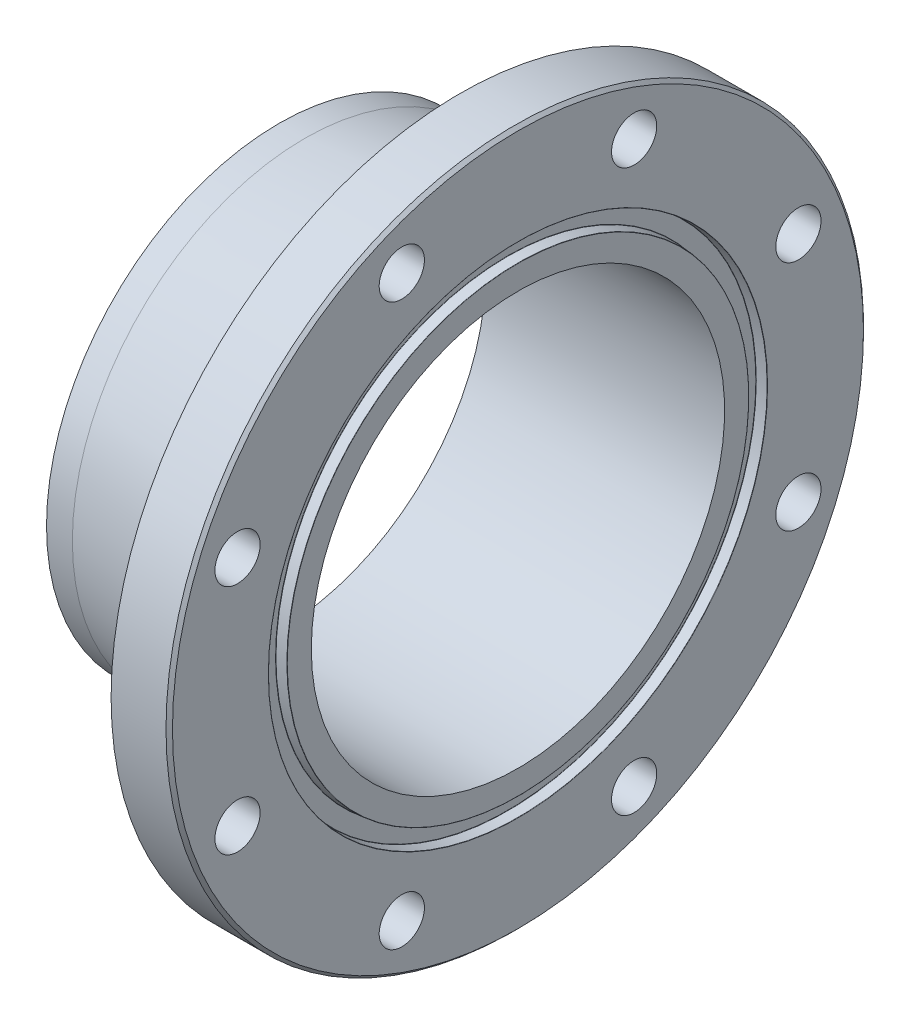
ISO-10303-21;
HEADER;
FILE_DESCRIPTION(('STEP AP214'),'2;1');
FILE_NAME('part.step','',(''),(''),'','','');
FILE_SCHEMA(('AUTOMOTIVE_DESIGN { 1 0 10303 214 1 1 1 1 }'));
ENDSEC;
DATA;
#1=APPLICATION_CONTEXT('core data for automotive mechanical design processes');
#2=APPLICATION_PROTOCOL_DEFINITION('international standard','automotive_design',2000,#1);
#3=PRODUCT_CONTEXT('',#1,'mechanical');
#4=PRODUCT('Part','Part','',(#3));
#5=PRODUCT_RELATED_PRODUCT_CATEGORY('part','',(#4));
#6=PRODUCT_DEFINITION_FORMATION('','',#4);
#7=PRODUCT_DEFINITION_CONTEXT('part definition',#1,'design');
#8=PRODUCT_DEFINITION('design','',#6,#7);
#9=PRODUCT_DEFINITION_SHAPE('','',#8);
#10=(LENGTH_UNIT() NAMED_UNIT(*) SI_UNIT(.MILLI.,.METRE.));
#11=(NAMED_UNIT(*) PLANE_ANGLE_UNIT() SI_UNIT($,.RADIAN.));
#12=(NAMED_UNIT(*) SI_UNIT($,.STERADIAN.) SOLID_ANGLE_UNIT());
#13=UNCERTAINTY_MEASURE_WITH_UNIT(LENGTH_MEASURE(1.E-05),#10,'distance_accuracy_value','');
#14=(GEOMETRIC_REPRESENTATION_CONTEXT(3) GLOBAL_UNCERTAINTY_ASSIGNED_CONTEXT((#13)) GLOBAL_UNIT_ASSIGNED_CONTEXT((#10,
#11,#12)) REPRESENTATION_CONTEXT('',''));
#15=CARTESIAN_POINT('',(0.,0.,0.));
#16=DIRECTION('',(0.,0.,1.));
#17=DIRECTION('',(1.,0.,0.));
#18=AXIS2_PLACEMENT_3D('',#15,#16,#17);
#19=CARTESIAN_POINT('',(0.,0.,-114.3));
#20=DIRECTION('',(1.,0.,0.));
#21=DIRECTION('',(0.,0.,-1.));
#22=AXIS2_PLACEMENT_3D('',#19,#20,#21);
#23=PLANE('',#22);
#24=CARTESIAN_POINT('',(0.,0.,0.));
#25=DIRECTION('',(-1.,0.,0.));
#26=DIRECTION('',(0.,0.,1.));
#27=AXIS2_PLACEMENT_3D('',#24,#25,#26);
#28=CIRCLE('',#27,101.6);
#29=CARTESIAN_POINT('',(0.,0.,101.6));
#30=VERTEX_POINT('',#29);
#31=EDGE_CURVE('E51',#30,#30,#28,.T.);
#32=ORIENTED_EDGE('',*,*,#31,.F.);
#33=EDGE_LOOP('',(#32));
#34=FACE_BOUND('',#33,.T.);
#35=CARTESIAN_POINT('',(0.,0.,0.));
#36=DIRECTION('',(-1.,0.,0.));
#37=DIRECTION('',(0.,0.,1.));
#38=AXIS2_PLACEMENT_3D('',#35,#36,#37);
#39=CIRCLE('',#38,114.3);
#40=CARTESIAN_POINT('',(0.,0.,114.3));
#41=VERTEX_POINT('',#40);
#42=EDGE_CURVE('E100',#41,#41,#39,.T.);
#43=ORIENTED_EDGE('',*,*,#42,.T.);
#44=EDGE_LOOP('',(#43));
#45=FACE_BOUND('',#44,.T.);
#46=ADVANCED_FACE('F31',(#34,#45),#23,.F.);
#47=CARTESIAN_POINT('',(0.,0.,0.));
#48=DIRECTION('',(-1.,0.,0.));
#49=DIRECTION('',(0.,0.,1.));
#50=AXIS2_PLACEMENT_3D('',#47,#48,#49);
#51=CYLINDRICAL_SURFACE('',#50,101.6);
#52=CARTESIAN_POINT('',(117.475,0.,0.));
#53=DIRECTION('',(-1.,0.,0.));
#54=DIRECTION('',(0.,0.,1.));
#55=AXIS2_PLACEMENT_3D('',#52,#53,#54);
#56=CIRCLE('',#55,101.6);
#57=CARTESIAN_POINT('',(117.475,0.,101.6));
#58=VERTEX_POINT('',#57);
#59=EDGE_CURVE('E67',#58,#58,#56,.T.);
#60=ORIENTED_EDGE('',*,*,#59,.F.);
#61=EDGE_LOOP('',(#60));
#62=FACE_BOUND('',#61,.T.);
#63=ORIENTED_EDGE('',*,*,#31,.T.);
#64=EDGE_LOOP('',(#63));
#65=FACE_BOUND('',#64,.T.);
#66=ADVANCED_FACE('F208',(#62,#65),#51,.F.);
#67=CARTESIAN_POINT('',(117.475,0.,-101.6));
#68=DIRECTION('',(-1.,0.,0.));
#69=DIRECTION('',(0.,0.,1.));
#70=AXIS2_PLACEMENT_3D('',#67,#68,#69);
#71=PLANE('',#70);
#72=CARTESIAN_POINT('',(117.475,0.,0.));
#73=DIRECTION('',(-1.,0.,0.));
#74=DIRECTION('',(0.,0.,1.));
#75=AXIS2_PLACEMENT_3D('',#72,#73,#74);
#76=CIRCLE('',#75,113.419461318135);
#77=CARTESIAN_POINT('',(117.475,0.,113.419461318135));
#78=VERTEX_POINT('',#77);
#79=EDGE_CURVE('E70',#78,#78,#76,.T.);
#80=ORIENTED_EDGE('',*,*,#79,.F.);
#81=EDGE_LOOP('',(#80));
#82=FACE_BOUND('',#81,.T.);
#83=ORIENTED_EDGE('',*,*,#59,.T.);
#84=EDGE_LOOP('',(#83));
#85=FACE_BOUND('',#84,.T.);
#86=ADVANCED_FACE('F202',(#82,#85),#71,.F.);
#87=CARTESIAN_POINT('',(117.348,0.,0.));
#88=DIRECTION('',(-1.,0.,0.));
#89=DIRECTION('',(0.,0.,1.));
#90=AXIS2_PLACEMENT_3D('',#87,#88,#89);
#91=TOROIDAL_SURFACE('',#90,113.419461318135,0.126999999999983);
#92=CARTESIAN_POINT('',(117.359068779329,0.,0.));
#93=DIRECTION('',(-1.,0.,0.));
#94=DIRECTION('',(0.,0.,1.));
#95=AXIS2_PLACEMENT_3D('',#92,#93,#94);
#96=CIRCLE('',#95,113.545978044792);
#97=CARTESIAN_POINT('',(117.359068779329,0.,113.545978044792));
#98=VERTEX_POINT('',#97);
#99=EDGE_CURVE('E73',#98,#98,#96,.T.);
#100=ORIENTED_EDGE('',*,*,#99,.F.);
#101=EDGE_LOOP('',(#100));
#102=FACE_BOUND('',#101,.T.);
#103=ORIENTED_EDGE('',*,*,#79,.T.);
#104=EDGE_LOOP('',(#103));
#105=FACE_BOUND('',#104,.T.);
#106=ADVANCED_FACE('F196',(#102,#105),#91,.T.);
#107=CARTESIAN_POINT('',(117.359068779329,0.,0.));
#108=DIRECTION('',(-1.,0.,0.));
#109=DIRECTION('',(0.,0.,1.));
#110=AXIS2_PLACEMENT_3D('',#107,#108,#109);
#111=CONICAL_SURFACE('',#110,113.545978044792,0.0872664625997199);
#112=CARTESIAN_POINT('',(112.485531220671,0.,0.));
#113=DIRECTION('',(-1.,0.,0.));
#114=DIRECTION('',(0.,0.,1.));
#115=AXIS2_PLACEMENT_3D('',#112,#113,#114);
#116=CIRCLE('',#115,113.972357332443);
#117=CARTESIAN_POINT('',(112.485531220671,0.,113.972357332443));
#118=VERTEX_POINT('',#117);
#119=EDGE_CURVE('E76',#118,#118,#116,.T.);
#120=ORIENTED_EDGE('',*,*,#119,.F.);
#121=EDGE_LOOP('',(#120));
#122=FACE_BOUND('',#121,.T.);
#123=ORIENTED_EDGE('',*,*,#99,.T.);
#124=EDGE_LOOP('',(#123));
#125=FACE_BOUND('',#124,.T.);
#126=ADVANCED_FACE('F190',(#122,#125),#111,.T.);
#127=CARTESIAN_POINT('',(112.4966,0.,0.));
#128=DIRECTION('',(-1.,0.,0.));
#129=DIRECTION('',(0.,0.,1.));
#130=AXIS2_PLACEMENT_3D('',#127,#128,#129);
#131=TOROIDAL_SURFACE('',#130,114.0988740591,0.127000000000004);
#132=CARTESIAN_POINT('',(112.3696,0.,0.));
#133=DIRECTION('',(-1.,0.,0.));
#134=DIRECTION('',(0.,0.,1.));
#135=AXIS2_PLACEMENT_3D('',#132,#133,#134);
#136=CIRCLE('',#135,114.0988740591);
#137=CARTESIAN_POINT('',(112.3696,0.,114.0988740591));
#138=VERTEX_POINT('',#137);
#139=EDGE_CURVE('E79',#138,#138,#136,.T.);
#140=ORIENTED_EDGE('',*,*,#139,.F.);
#141=EDGE_LOOP('',(#140));
#142=FACE_BOUND('',#141,.T.);
#143=ORIENTED_EDGE('',*,*,#119,.T.);
#144=EDGE_LOOP('',(#143));
#145=FACE_BOUND('',#144,.T.);
#146=ADVANCED_FACE('F184',(#142,#145),#131,.F.);
#147=CARTESIAN_POINT('',(112.3696,0.,-114.0988740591));
#148=DIRECTION('',(-1.,0.,0.));
#149=DIRECTION('',(0.,0.,1.));
#150=AXIS2_PLACEMENT_3D('',#147,#148,#149);
#151=PLANE('',#150);
#152=CARTESIAN_POINT('',(112.3696,0.,0.));
#153=DIRECTION('',(-1.,0.,0.));
#154=DIRECTION('',(0.,0.,1.));
#155=AXIS2_PLACEMENT_3D('',#152,#153,#154);
#156=CIRCLE('',#155,122.0449259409);
#157=CARTESIAN_POINT('',(112.3696,0.,122.0449259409));
#158=VERTEX_POINT('',#157);
#159=EDGE_CURVE('E82',#158,#158,#156,.T.);
#160=ORIENTED_EDGE('',*,*,#159,.F.);
#161=EDGE_LOOP('',(#160));
#162=FACE_BOUND('',#161,.T.);
#163=ORIENTED_EDGE('',*,*,#139,.T.);
#164=EDGE_LOOP('',(#163));
#165=FACE_BOUND('',#164,.T.);
#166=ADVANCED_FACE('F178',(#162,#165),#151,.F.);
#167=CARTESIAN_POINT('',(112.4966,0.,0.));
#168=DIRECTION('',(-1.,0.,0.));
#169=DIRECTION('',(0.,0.,1.));
#170=AXIS2_PLACEMENT_3D('',#167,#168,#169);
#171=TOROIDAL_SURFACE('',#170,122.0449259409,0.127000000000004);
#172=CARTESIAN_POINT('',(112.485531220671,0.,0.));
#173=DIRECTION('',(-1.,0.,0.));
#174=DIRECTION('',(0.,0.,1.));
#175=AXIS2_PLACEMENT_3D('',#172,#173,#174);
#176=CIRCLE('',#175,122.171442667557);
#177=CARTESIAN_POINT('',(112.485531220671,0.,122.171442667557));
#178=VERTEX_POINT('',#177);
#179=EDGE_CURVE('E85',#178,#178,#176,.T.);
#180=ORIENTED_EDGE('',*,*,#179,.F.);
#181=EDGE_LOOP('',(#180));
#182=FACE_BOUND('',#181,.T.);
#183=ORIENTED_EDGE('',*,*,#159,.T.);
#184=EDGE_LOOP('',(#183));
#185=FACE_BOUND('',#184,.T.);
#186=ADVANCED_FACE('F172',(#182,#185),#171,.F.);
#187=CARTESIAN_POINT('',(112.485531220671,0.,0.));
#188=DIRECTION('',(1.,0.,0.));
#189=DIRECTION('',(0.,0.,-1.));
#190=AXIS2_PLACEMENT_3D('',#187,#188,#189);
#191=CONICAL_SURFACE('',#190,122.171442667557,0.0872664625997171);
#192=CARTESIAN_POINT('',(117.359068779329,0.,0.));
#193=DIRECTION('',(-1.,0.,0.));
#194=DIRECTION('',(0.,0.,1.));
#195=AXIS2_PLACEMENT_3D('',#192,#193,#194);
#196=CIRCLE('',#195,122.597821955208);
#197=CARTESIAN_POINT('',(117.359068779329,0.,122.597821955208));
#198=VERTEX_POINT('',#197);
#199=EDGE_CURVE('E88',#198,#198,#196,.T.);
#200=ORIENTED_EDGE('',*,*,#199,.F.);
#201=EDGE_LOOP('',(#200));
#202=FACE_BOUND('',#201,.T.);
#203=ORIENTED_EDGE('',*,*,#179,.T.);
#204=EDGE_LOOP('',(#203));
#205=FACE_BOUND('',#204,.T.);
#206=ADVANCED_FACE('F166',(#202,#205),#191,.F.);
#207=CARTESIAN_POINT('',(117.348,0.,0.));
#208=DIRECTION('',(-1.,0.,0.));
#209=DIRECTION('',(0.,0.,1.));
#210=AXIS2_PLACEMENT_3D('',#207,#208,#209);
#211=TOROIDAL_SURFACE('',#210,122.724338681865,0.126999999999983);
#212=CARTESIAN_POINT('',(117.475,0.,0.));
#213=DIRECTION('',(-1.,0.,0.));
#214=DIRECTION('',(0.,0.,1.));
#215=AXIS2_PLACEMENT_3D('',#212,#213,#214);
#216=CIRCLE('',#215,122.724338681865);
#217=CARTESIAN_POINT('',(117.475,0.,122.724338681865));
#218=VERTEX_POINT('',#217);
#219=EDGE_CURVE('E91',#218,#218,#216,.T.);
#220=ORIENTED_EDGE('',*,*,#219,.F.);
#221=EDGE_LOOP('',(#220));
#222=FACE_BOUND('',#221,.T.);
#223=ORIENTED_EDGE('',*,*,#199,.T.);
#224=EDGE_LOOP('',(#223));
#225=FACE_BOUND('',#224,.T.);
#226=ADVANCED_FACE('F146',(#222,#225),#211,.T.);
#227=CARTESIAN_POINT('',(117.475,0.,-122.724338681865));
#228=DIRECTION('',(-1.,0.,0.));
#229=DIRECTION('',(0.,0.,1.));
#230=AXIS2_PLACEMENT_3D('',#227,#228,#229);
#231=PLANE('',#230);
#232=CARTESIAN_POINT('',(117.475,0.,0.));
#233=DIRECTION('',(-1.,0.,0.));
#234=DIRECTION('',(0.,0.,1.));
#235=AXIS2_PLACEMENT_3D('',#232,#233,#234);
#236=CIRCLE('',#235,169.8625);
#237=CARTESIAN_POINT('',(117.475,0.,169.8625));
#238=VERTEX_POINT('',#237);
#239=EDGE_CURVE('E10',#238,#238,#236,.F.);
#240=ORIENTED_EDGE('',*,*,#239,.T.);
#241=EDGE_LOOP('',(#240));
#242=FACE_BOUND('',#241,.T.);
#243=CARTESIAN_POINT('',(117.475,137.865923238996,57.1059351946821));
#244=DIRECTION('',(1.,0.,0.));
#245=DIRECTION('',(0.,0.,-1.));
#246=AXIS2_PLACEMENT_3D('',#243,#244,#245);
#247=CIRCLE('',#246,11.1125);
#248=CARTESIAN_POINT('',(117.475,137.865923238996,45.9934351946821));
#249=VERTEX_POINT('',#248);
#250=EDGE_CURVE('E56',#249,#249,#247,.T.);
#251=ORIENTED_EDGE('',*,*,#250,.F.);
#252=EDGE_LOOP('',(#251));
#253=FACE_BOUND('',#252,.T.);
#254=CARTESIAN_POINT('',(117.475,137.865923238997,-57.1059351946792));
#255=DIRECTION('',(1.,0.,0.));
#256=DIRECTION('',(0.,0.,-1.));
#257=AXIS2_PLACEMENT_3D('',#254,#255,#256);
#258=CIRCLE('',#257,11.1125);
#259=CARTESIAN_POINT('',(117.475,137.865923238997,-68.2184351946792));
#260=VERTEX_POINT('',#259);
#261=EDGE_CURVE('E55',#260,#260,#258,.T.);
#262=ORIENTED_EDGE('',*,*,#261,.F.);
#263=EDGE_LOOP('',(#262));
#264=FACE_BOUND('',#263,.T.);
#265=CARTESIAN_POINT('',(117.475,57.1059351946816,-137.865923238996));
#266=DIRECTION('',(1.,0.,0.));
#267=DIRECTION('',(0.,0.,-1.));
#268=AXIS2_PLACEMENT_3D('',#265,#266,#267);
#269=CIRCLE('',#268,11.1125);
#270=CARTESIAN_POINT('',(117.475,57.1059351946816,-148.978423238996));
#271=VERTEX_POINT('',#270);
#272=EDGE_CURVE('E60',#271,#271,#269,.T.);
#273=ORIENTED_EDGE('',*,*,#272,.F.);
#274=EDGE_LOOP('',(#273));
#275=FACE_BOUND('',#274,.T.);
#276=CARTESIAN_POINT('',(117.475,-57.1059351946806,-137.865923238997));
#277=DIRECTION('',(1.,0.,0.));
#278=DIRECTION('',(0.,0.,-1.));
#279=AXIS2_PLACEMENT_3D('',#276,#277,#278);
#280=CIRCLE('',#279,11.1125);
#281=CARTESIAN_POINT('',(117.475,-57.1059351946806,-148.978423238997));
#282=VERTEX_POINT('',#281);
#283=EDGE_CURVE('E64',#282,#282,#280,.T.);
#284=ORIENTED_EDGE('',*,*,#283,.F.);
#285=EDGE_LOOP('',(#284));
#286=FACE_BOUND('',#285,.T.);
#287=CARTESIAN_POINT('',(117.475,-137.865923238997,-57.1059351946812));
#288=DIRECTION('',(1.,0.,0.));
#289=DIRECTION('',(0.,0.,-1.));
#290=AXIS2_PLACEMENT_3D('',#287,#288,#289);
#291=CIRCLE('',#290,11.1125);
#292=CARTESIAN_POINT('',(117.475,-137.865923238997,-68.2184351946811));
#293=VERTEX_POINT('',#292);
#294=EDGE_CURVE('E124',#293,#293,#291,.T.);
#295=ORIENTED_EDGE('',*,*,#294,.F.);
#296=EDGE_LOOP('',(#295));
#297=FACE_BOUND('',#296,.T.);
#298=CARTESIAN_POINT('',(117.475,-137.865923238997,57.1059351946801));
#299=DIRECTION('',(1.,0.,0.));
#300=DIRECTION('',(0.,0.,-1.));
#301=AXIS2_PLACEMENT_3D('',#298,#299,#300);
#302=CIRCLE('',#301,11.1125);
#303=CARTESIAN_POINT('',(117.475,-137.865923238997,45.9934351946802));
#304=VERTEX_POINT('',#303);
#305=EDGE_CURVE('E118',#304,#304,#302,.T.);
#306=ORIENTED_EDGE('',*,*,#305,.F.);
#307=EDGE_LOOP('',(#306));
#308=FACE_BOUND('',#307,.T.);
#309=CARTESIAN_POINT('',(117.475,-57.1059351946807,137.865923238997));
#310=DIRECTION('',(1.,0.,0.));
#311=DIRECTION('',(0.,0.,-1.));
#312=AXIS2_PLACEMENT_3D('',#309,#310,#311);
#313=CIRCLE('',#312,11.1125);
#314=CARTESIAN_POINT('',(117.475,-57.1059351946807,126.753423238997));
#315=VERTEX_POINT('',#314);
#316=EDGE_CURVE('E112',#315,#315,#313,.T.);
#317=ORIENTED_EDGE('',*,*,#316,.F.);
#318=EDGE_LOOP('',(#317));
#319=FACE_BOUND('',#318,.T.);
#320=CARTESIAN_POINT('',(117.475,57.1059351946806,137.865923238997));
#321=DIRECTION('',(1.,0.,0.));
#322=DIRECTION('',(0.,0.,-1.));
#323=AXIS2_PLACEMENT_3D('',#320,#321,#322);
#324=CIRCLE('',#323,11.1125);
#325=CARTESIAN_POINT('',(117.475,57.1059351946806,126.753423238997));
#326=VERTEX_POINT('',#325);
#327=EDGE_CURVE('E106',#326,#326,#324,.T.);
#328=ORIENTED_EDGE('',*,*,#327,.F.);
#329=EDGE_LOOP('',(#328));
#330=FACE_BOUND('',#329,.T.);
#331=ORIENTED_EDGE('',*,*,#219,.T.);
#332=EDGE_LOOP('',(#331));
#333=FACE_BOUND('',#332,.T.);
#334=ADVANCED_FACE('F142',(#242,#253,#264,#275,#286,#297,#308,#319,#330,#333),#231,.F.);
#335=CARTESIAN_POINT('',(0.,0.,0.));
#336=DIRECTION('',(-1.,0.,0.));
#337=DIRECTION('',(0.,0.,1.));
#338=AXIS2_PLACEMENT_3D('',#335,#336,#337);
#339=CYLINDRICAL_SURFACE('',#338,171.45);
#340=CARTESIAN_POINT('',(115.8875,0.,0.));
#341=DIRECTION('',(-1.,0.,0.));
#342=DIRECTION('',(0.,0.,1.));
#343=AXIS2_PLACEMENT_3D('',#340,#341,#342);
#344=CIRCLE('',#343,171.45);
#345=CARTESIAN_POINT('',(115.8875,0.,171.45));
#346=VERTEX_POINT('',#345);
#347=EDGE_CURVE('E38',#346,#346,#344,.T.);
#348=ORIENTED_EDGE('',*,*,#347,.T.);
#349=EDGE_LOOP('',(#348));
#350=FACE_BOUND('',#349,.T.);
#351=CARTESIAN_POINT('',(88.9,0.,0.));
#352=DIRECTION('',(-1.,0.,0.));
#353=DIRECTION('',(0.,0.,1.));
#354=AXIS2_PLACEMENT_3D('',#351,#352,#353);
#355=CIRCLE('',#354,171.45);
#356=CARTESIAN_POINT('',(88.9,0.,171.45));
#357=VERTEX_POINT('',#356);
#358=EDGE_CURVE('E94',#357,#357,#355,.T.);
#359=ORIENTED_EDGE('',*,*,#358,.F.);
#360=EDGE_LOOP('',(#359));
#361=FACE_BOUND('',#360,.T.);
#362=ADVANCED_FACE('F145',(#350,#361),#339,.T.);
#363=CARTESIAN_POINT('',(88.9,0.,-171.45));
#364=DIRECTION('',(1.,0.,0.));
#365=DIRECTION('',(0.,0.,-1.));
#366=AXIS2_PLACEMENT_3D('',#363,#364,#365);
#367=PLANE('',#366);
#368=CARTESIAN_POINT('',(88.9,0.,0.));
#369=DIRECTION('',(1.,0.,0.));
#370=DIRECTION('',(0.,0.,-1.));
#371=AXIS2_PLACEMENT_3D('',#368,#369,#370);
#372=CIRCLE('',#371,132.233500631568);
#373=CARTESIAN_POINT('',(88.9,0.,-132.233500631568));
#374=VERTEX_POINT('',#373);
#375=EDGE_CURVE('E42',#374,#374,#372,.T.);
#376=ORIENTED_EDGE('',*,*,#375,.T.);
#377=EDGE_LOOP('',(#376));
#378=FACE_BOUND('',#377,.T.);
#379=CARTESIAN_POINT('',(88.9,137.865923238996,57.1059351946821));
#380=DIRECTION('',(1.,0.,0.));
#381=DIRECTION('',(0.,0.,-1.));
#382=AXIS2_PLACEMENT_3D('',#379,#380,#381);
#383=CIRCLE('',#382,11.1125);
#384=CARTESIAN_POINT('',(88.9,137.865923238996,45.9934351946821));
#385=VERTEX_POINT('',#384);
#386=EDGE_CURVE('E52',#385,#385,#383,.T.);
#387=ORIENTED_EDGE('',*,*,#386,.T.);
#388=EDGE_LOOP('',(#387));
#389=FACE_BOUND('',#388,.T.);
#390=CARTESIAN_POINT('',(88.9,137.865923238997,-57.1059351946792));
#391=DIRECTION('',(1.,0.,0.));
#392=DIRECTION('',(0.,0.,-1.));
#393=AXIS2_PLACEMENT_3D('',#390,#391,#392);
#394=CIRCLE('',#393,11.1125);
#395=CARTESIAN_POINT('',(88.9,137.865923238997,-68.2184351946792));
#396=VERTEX_POINT('',#395);
#397=EDGE_CURVE('E57',#396,#396,#394,.T.);
#398=ORIENTED_EDGE('',*,*,#397,.T.);
#399=EDGE_LOOP('',(#398));
#400=FACE_BOUND('',#399,.T.);
#401=CARTESIAN_POINT('',(88.9,57.1059351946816,-137.865923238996));
#402=DIRECTION('',(1.,0.,0.));
#403=DIRECTION('',(0.,0.,-1.));
#404=AXIS2_PLACEMENT_3D('',#401,#402,#403);
#405=CIRCLE('',#404,11.1125);
#406=CARTESIAN_POINT('',(88.9,57.1059351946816,-148.978423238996));
#407=VERTEX_POINT('',#406);
#408=EDGE_CURVE('E61',#407,#407,#405,.T.);
#409=ORIENTED_EDGE('',*,*,#408,.T.);
#410=EDGE_LOOP('',(#409));
#411=FACE_BOUND('',#410,.T.);
#412=CARTESIAN_POINT('',(88.9,-57.1059351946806,-137.865923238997));
#413=DIRECTION('',(1.,0.,0.));
#414=DIRECTION('',(0.,0.,-1.));
#415=AXIS2_PLACEMENT_3D('',#412,#413,#414);
#416=CIRCLE('',#415,11.1125);
#417=CARTESIAN_POINT('',(88.9,-57.1059351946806,-148.978423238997));
#418=VERTEX_POINT('',#417);
#419=EDGE_CURVE('E127',#418,#418,#416,.T.);
#420=ORIENTED_EDGE('',*,*,#419,.T.);
#421=EDGE_LOOP('',(#420));
#422=FACE_BOUND('',#421,.T.);
#423=CARTESIAN_POINT('',(88.9,-137.865923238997,-57.1059351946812));
#424=DIRECTION('',(1.,0.,0.));
#425=DIRECTION('',(0.,0.,-1.));
#426=AXIS2_PLACEMENT_3D('',#423,#424,#425);
#427=CIRCLE('',#426,11.1125);
#428=CARTESIAN_POINT('',(88.9,-137.865923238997,-68.2184351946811));
#429=VERTEX_POINT('',#428);
#430=EDGE_CURVE('E121',#429,#429,#427,.T.);
#431=ORIENTED_EDGE('',*,*,#430,.T.);
#432=EDGE_LOOP('',(#431));
#433=FACE_BOUND('',#432,.T.);
#434=CARTESIAN_POINT('',(88.9,-137.865923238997,57.1059351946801));
#435=DIRECTION('',(1.,0.,0.));
#436=DIRECTION('',(0.,0.,-1.));
#437=AXIS2_PLACEMENT_3D('',#434,#435,#436);
#438=CIRCLE('',#437,11.1125);
#439=CARTESIAN_POINT('',(88.9,-137.865923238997,45.9934351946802));
#440=VERTEX_POINT('',#439);
#441=EDGE_CURVE('E115',#440,#440,#438,.T.);
#442=ORIENTED_EDGE('',*,*,#441,.T.);
#443=EDGE_LOOP('',(#442));
#444=FACE_BOUND('',#443,.T.);
#445=CARTESIAN_POINT('',(88.9,-57.1059351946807,137.865923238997));
#446=DIRECTION('',(1.,0.,0.));
#447=DIRECTION('',(0.,0.,-1.));
#448=AXIS2_PLACEMENT_3D('',#445,#446,#447);
#449=CIRCLE('',#448,11.1125);
#450=CARTESIAN_POINT('',(88.9,-57.1059351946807,126.753423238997));
#451=VERTEX_POINT('',#450);
#452=EDGE_CURVE('E109',#451,#451,#449,.T.);
#453=ORIENTED_EDGE('',*,*,#452,.T.);
#454=EDGE_LOOP('',(#453));
#455=FACE_BOUND('',#454,.T.);
#456=CARTESIAN_POINT('',(88.9,57.1059351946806,137.865923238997));
#457=DIRECTION('',(1.,0.,0.));
#458=DIRECTION('',(0.,0.,-1.));
#459=AXIS2_PLACEMENT_3D('',#456,#457,#458);
#460=CIRCLE('',#459,11.1125);
#461=CARTESIAN_POINT('',(88.9,57.1059351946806,126.753423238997));
#462=VERTEX_POINT('',#461);
#463=EDGE_CURVE('E103',#462,#462,#460,.T.);
#464=ORIENTED_EDGE('',*,*,#463,.T.);
#465=EDGE_LOOP('',(#464));
#466=FACE_BOUND('',#465,.T.);
#467=ORIENTED_EDGE('',*,*,#358,.T.);
#468=EDGE_LOOP('',(#467));
#469=FACE_BOUND('',#468,.T.);
#470=ADVANCED_FACE('F231',(#378,#389,#400,#411,#422,#433,#444,#455,#466,#469),#367,.F.);
#471=CARTESIAN_POINT('',(88.9,0.,0.));
#472=DIRECTION('',(1.,0.,0.));
#473=DIRECTION('',(0.,0.,-1.));
#474=AXIS2_PLACEMENT_3D('',#471,#472,#473);
#475=CONICAL_SURFACE('',#474,123.825,0.124354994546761);
#476=CARTESIAN_POINT('',(80.5564308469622,0.,0.));
#477=DIRECTION('',(1.,0.,0.));
#478=DIRECTION('',(0.,0.,-1.));
#479=AXIS2_PLACEMENT_3D('',#476,#477,#478);
#480=CIRCLE('',#479,122.78205385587);
#481=CARTESIAN_POINT('',(80.5564308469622,0.,-122.78205385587));
#482=VERTEX_POINT('',#481);
#483=EDGE_CURVE('E46',#482,#482,#480,.F.);
#484=ORIENTED_EDGE('',*,*,#483,.T.);
#485=EDGE_LOOP('',(#484));
#486=FACE_BOUND('',#485,.T.);
#487=CARTESIAN_POINT('',(12.7,0.,0.));
#488=DIRECTION('',(-1.,0.,0.));
#489=DIRECTION('',(0.,0.,1.));
#490=AXIS2_PLACEMENT_3D('',#487,#488,#489);
#491=CIRCLE('',#490,114.3);
#492=CARTESIAN_POINT('',(12.7,0.,114.3));
#493=VERTEX_POINT('',#492);
#494=EDGE_CURVE('E97',#493,#493,#491,.T.);
#495=ORIENTED_EDGE('',*,*,#494,.F.);
#496=EDGE_LOOP('',(#495));
#497=FACE_BOUND('',#496,.T.);
#498=ADVANCED_FACE('F226',(#486,#497),#475,.T.);
#499=CARTESIAN_POINT('',(0.,0.,0.));
#500=DIRECTION('',(-1.,0.,0.));
#501=DIRECTION('',(0.,0.,1.));
#502=AXIS2_PLACEMENT_3D('',#499,#500,#501);
#503=CYLINDRICAL_SURFACE('',#502,114.3);
#504=ORIENTED_EDGE('',*,*,#42,.F.);
#505=EDGE_LOOP('',(#504));
#506=FACE_BOUND('',#505,.T.);
#507=ORIENTED_EDGE('',*,*,#494,.T.);
#508=EDGE_LOOP('',(#507));
#509=FACE_BOUND('',#508,.T.);
#510=ADVANCED_FACE('F222',(#506,#509),#503,.T.);
#511=CARTESIAN_POINT('',(117.475,57.1059351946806,137.865923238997));
#512=DIRECTION('',(1.,0.,0.));
#513=DIRECTION('',(0.,0.,-1.));
#514=AXIS2_PLACEMENT_3D('',#511,#512,#513);
#515=CYLINDRICAL_SURFACE('',#514,11.1125);
#516=ORIENTED_EDGE('',*,*,#327,.T.);
#517=EDGE_LOOP('',(#516));
#518=FACE_BOUND('',#517,.T.);
#519=ORIENTED_EDGE('',*,*,#463,.F.);
#520=EDGE_LOOP('',(#519));
#521=FACE_BOUND('',#520,.T.);
#522=ADVANCED_FACE('F225',(#518,#521),#515,.F.);
#523=CARTESIAN_POINT('',(117.475,-57.1059351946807,137.865923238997));
#524=DIRECTION('',(1.,0.,0.));
#525=DIRECTION('',(0.,0.,-1.));
#526=AXIS2_PLACEMENT_3D('',#523,#524,#525);
#527=CYLINDRICAL_SURFACE('',#526,11.1125);
#528=ORIENTED_EDGE('',*,*,#316,.T.);
#529=EDGE_LOOP('',(#528));
#530=FACE_BOUND('',#529,.T.);
#531=ORIENTED_EDGE('',*,*,#452,.F.);
#532=EDGE_LOOP('',(#531));
#533=FACE_BOUND('',#532,.T.);
#534=ADVANCED_FACE('F276',(#530,#533),#527,.F.);
#535=CARTESIAN_POINT('',(117.475,-137.865923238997,57.1059351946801));
#536=DIRECTION('',(1.,0.,0.));
#537=DIRECTION('',(0.,0.,-1.));
#538=AXIS2_PLACEMENT_3D('',#535,#536,#537);
#539=CYLINDRICAL_SURFACE('',#538,11.1125);
#540=ORIENTED_EDGE('',*,*,#305,.T.);
#541=EDGE_LOOP('',(#540));
#542=FACE_BOUND('',#541,.T.);
#543=ORIENTED_EDGE('',*,*,#441,.F.);
#544=EDGE_LOOP('',(#543));
#545=FACE_BOUND('',#544,.T.);
#546=ADVANCED_FACE('F281',(#542,#545),#539,.F.);
#547=CARTESIAN_POINT('',(117.475,-137.865923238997,-57.1059351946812));
#548=DIRECTION('',(1.,0.,0.));
#549=DIRECTION('',(0.,0.,-1.));
#550=AXIS2_PLACEMENT_3D('',#547,#548,#549);
#551=CYLINDRICAL_SURFACE('',#550,11.1125);
#552=ORIENTED_EDGE('',*,*,#294,.T.);
#553=EDGE_LOOP('',(#552));
#554=FACE_BOUND('',#553,.T.);
#555=ORIENTED_EDGE('',*,*,#430,.F.);
#556=EDGE_LOOP('',(#555));
#557=FACE_BOUND('',#556,.T.);
#558=ADVANCED_FACE('F287',(#554,#557),#551,.F.);
#559=CARTESIAN_POINT('',(117.475,-57.1059351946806,-137.865923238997));
#560=DIRECTION('',(1.,0.,0.));
#561=DIRECTION('',(0.,0.,-1.));
#562=AXIS2_PLACEMENT_3D('',#559,#560,#561);
#563=CYLINDRICAL_SURFACE('',#562,11.1125);
#564=ORIENTED_EDGE('',*,*,#283,.T.);
#565=EDGE_LOOP('',(#564));
#566=FACE_BOUND('',#565,.T.);
#567=ORIENTED_EDGE('',*,*,#419,.F.);
#568=EDGE_LOOP('',(#567));
#569=FACE_BOUND('',#568,.T.);
#570=ADVANCED_FACE('F291',(#566,#569),#563,.F.);
#571=CARTESIAN_POINT('',(117.475,57.1059351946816,-137.865923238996));
#572=DIRECTION('',(1.,0.,0.));
#573=DIRECTION('',(0.,0.,-1.));
#574=AXIS2_PLACEMENT_3D('',#571,#572,#573);
#575=CYLINDRICAL_SURFACE('',#574,11.1125);
#576=ORIENTED_EDGE('',*,*,#272,.T.);
#577=EDGE_LOOP('',(#576));
#578=FACE_BOUND('',#577,.T.);
#579=ORIENTED_EDGE('',*,*,#408,.F.);
#580=EDGE_LOOP('',(#579));
#581=FACE_BOUND('',#580,.T.);
#582=ADVANCED_FACE('F295',(#578,#581),#575,.F.);
#583=CARTESIAN_POINT('',(117.475,137.865923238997,-57.1059351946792));
#584=DIRECTION('',(1.,0.,0.));
#585=DIRECTION('',(0.,0.,-1.));
#586=AXIS2_PLACEMENT_3D('',#583,#584,#585);
#587=CYLINDRICAL_SURFACE('',#586,11.1125);
#588=ORIENTED_EDGE('',*,*,#261,.T.);
#589=EDGE_LOOP('',(#588));
#590=FACE_BOUND('',#589,.T.);
#591=ORIENTED_EDGE('',*,*,#397,.F.);
#592=EDGE_LOOP('',(#591));
#593=FACE_BOUND('',#592,.T.);
#594=ADVANCED_FACE('F250',(#590,#593),#587,.F.);
#595=CARTESIAN_POINT('',(117.475,137.865923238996,57.1059351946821));
#596=DIRECTION('',(1.,0.,0.));
#597=DIRECTION('',(0.,0.,-1.));
#598=AXIS2_PLACEMENT_3D('',#595,#596,#597);
#599=CYLINDRICAL_SURFACE('',#598,11.1125);
#600=ORIENTED_EDGE('',*,*,#250,.T.);
#601=EDGE_LOOP('',(#600));
#602=FACE_BOUND('',#601,.T.);
#603=ORIENTED_EDGE('',*,*,#386,.F.);
#604=EDGE_LOOP('',(#603));
#605=FACE_BOUND('',#604,.T.);
#606=ADVANCED_FACE('F139',(#602,#605),#599,.F.);
#607=CARTESIAN_POINT('',(79.375,0.,0.));
#608=DIRECTION('',(1.,0.,0.));
#609=DIRECTION('',(0.,0.,-1.));
#610=AXIS2_PLACEMENT_3D('',#607,#608,#609);
#611=TOROIDAL_SURFACE('',#610,132.233500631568,9.525);
#612=ORIENTED_EDGE('',*,*,#375,.F.);
#613=EDGE_LOOP('',(#612));
#614=FACE_BOUND('',#613,.T.);
#615=ORIENTED_EDGE('',*,*,#483,.F.);
#616=EDGE_LOOP('',(#615));
#617=FACE_BOUND('',#616,.T.);
#618=ADVANCED_FACE('F242',(#614,#617),#611,.F.);
#619=CARTESIAN_POINT('',(115.8875,0.,0.));
#620=DIRECTION('',(-1.,0.,0.));
#621=DIRECTION('',(0.,0.,1.));
#622=AXIS2_PLACEMENT_3D('',#619,#620,#621);
#623=CONICAL_SURFACE('',#622,171.45,0.78539816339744);
#624=ORIENTED_EDGE('',*,*,#239,.F.);
#625=EDGE_LOOP('',(#624));
#626=FACE_BOUND('',#625,.T.);
#627=ORIENTED_EDGE('',*,*,#347,.F.);
#628=EDGE_LOOP('',(#627));
#629=FACE_BOUND('',#628,.T.);
#630=ADVANCED_FACE('F33',(#626,#629),#623,.T.);
#631=CLOSED_SHELL('',(#46,#66,#86,#106,#126,#146,#166,#186,#206,#226,#334,#362,#470,#498,#510,
#522,#534,#546,#558,#570,#582,#594,#606,#618,#630));
#632=MANIFOLD_SOLID_BREP('B2',#631);
#633=ADVANCED_BREP_SHAPE_REPRESENTATION('',(#18,#632),#14);
#634=SHAPE_DEFINITION_REPRESENTATION(#9,#633);
ENDSEC;
END-ISO-10303-21;
